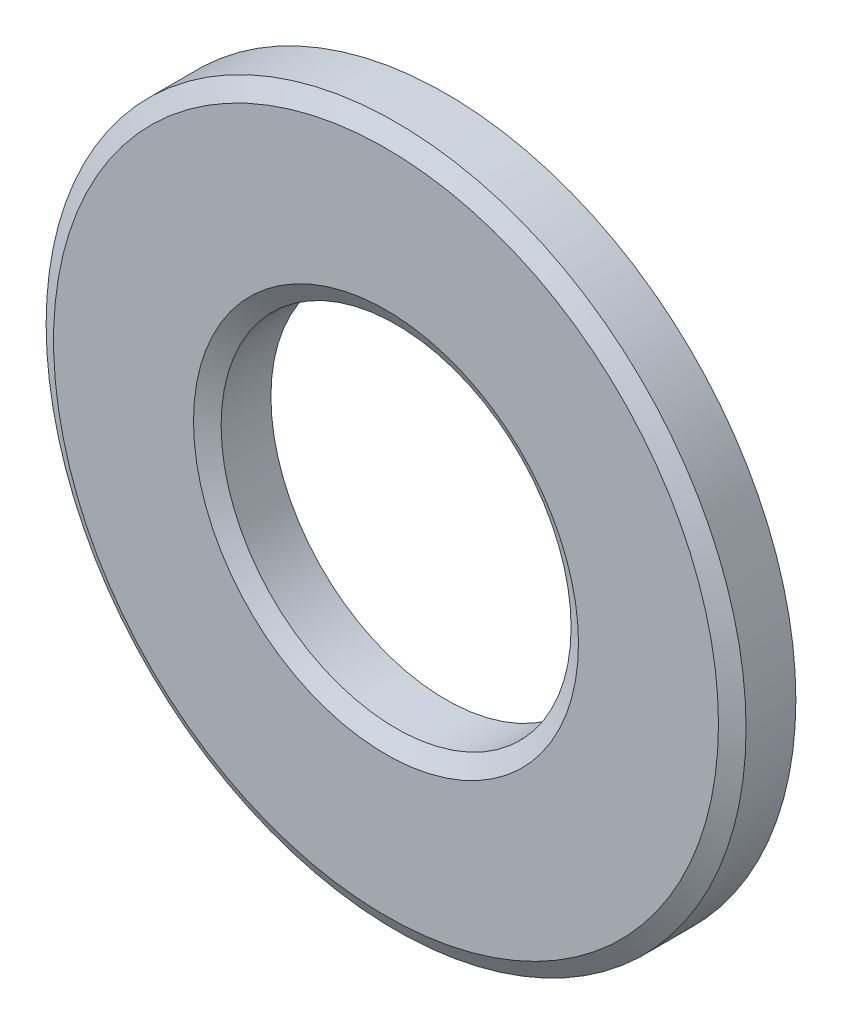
from build123d import *
from OCP.BRepFilletAPI import BRepFilletAPI_MakeChamfer

# Parameters (mm, degrees)
ESQUISSE1_R          = 6
ESQUISSE1_R_2        = 3
BASE_EXTRUSION_DEPTH = 1.2
CHANFREIN1_SIZE      = 0.3
CHANFREIN1_SIZE2     = 0.173205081


with BuildPart() as part:
    # Esquisse1 → Base-Extrusion (new body)
    with BuildSketch(Plane.XY):
        Circle(ESQUISSE1_R)
        Circle(ESQUISSE1_R_2, mode=Mode.SUBTRACT)
    extrude(amount=BASE_EXTRUSION_DEPTH)

    # Chanfrein1: one chamfer whose edges measure the first distance from different faces: ONE call of the kernel's chamfer builder (chamfer() names one face for all edges)
    chanfrein1_edges_1 = [part.edges().sort_by_distance(p)[0] for p in [
        (-6, 0, 0),
        (-3, 0, 0),
    ]]
    chanfrein1_side_1 = [part.faces().sort_by_distance(p)[0] for p in [
        (-5.830294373, 0, 0),
    ]]
    chanfrein1_edges_2 = [part.edges().sort_by_distance(p)[0] for p in [
        (-6, 0, 1.2),
        (-3, 0, 1.2),
    ]]
    chanfrein1_side_2 = [part.faces().sort_by_distance(p)[0] for p in [
        (-5.830294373, 0, 1.2),
    ]]
    chanfrein1 = BRepFilletAPI_MakeChamfer(part.part.solid().wrapped)
    for e in chanfrein1_edges_1:
        chanfrein1.Add(CHANFREIN1_SIZE, CHANFREIN1_SIZE2, e.wrapped, chanfrein1_side_1[0].wrapped)  # the first distance lies on this face
    for e in chanfrein1_edges_2:
        chanfrein1.Add(CHANFREIN1_SIZE, CHANFREIN1_SIZE2, e.wrapped, chanfrein1_side_2[0].wrapped)  # the first distance lies on this face
    add(Compound.cast(chanfrein1.Shape()), mode=Mode.REPLACE)


solid = part.part
